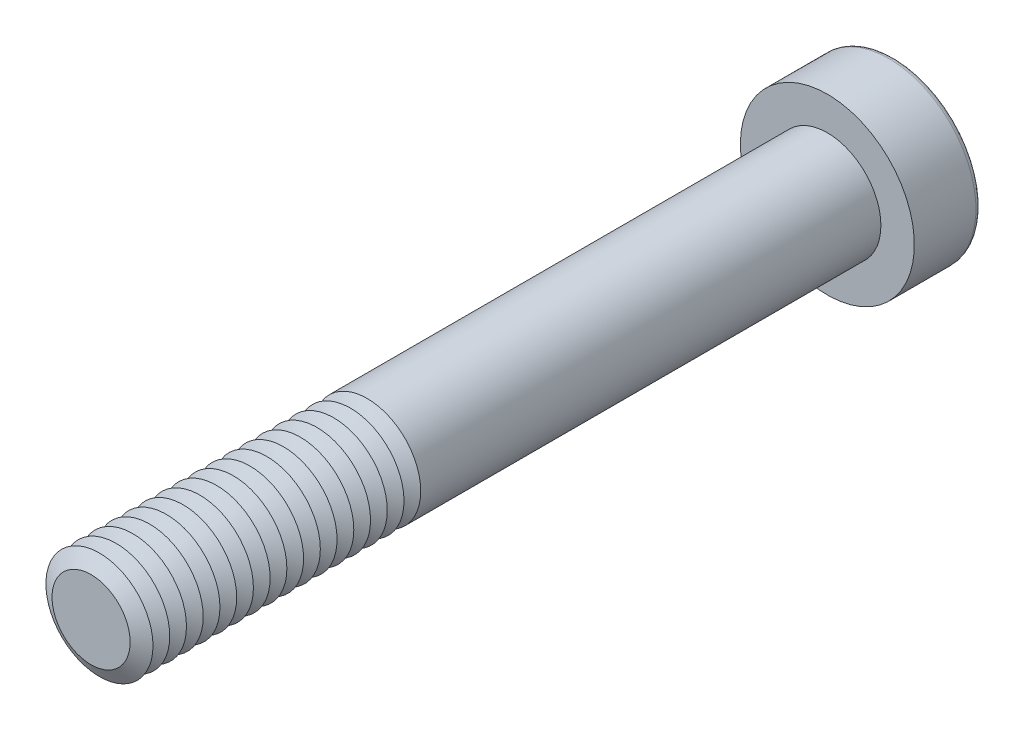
ISO-10303-21;
HEADER;
FILE_DESCRIPTION(('STEP AP214'),'2;1');
FILE_NAME('part.step','',(''),(''),'','','');
FILE_SCHEMA(('AUTOMOTIVE_DESIGN { 1 0 10303 214 1 1 1 1 }'));
ENDSEC;
DATA;
#1=APPLICATION_CONTEXT('core data for automotive mechanical design processes');
#2=APPLICATION_PROTOCOL_DEFINITION('international standard','automotive_design',2000,#1);
#3=PRODUCT_CONTEXT('',#1,'mechanical');
#4=PRODUCT('Part','Part','',(#3));
#5=PRODUCT_RELATED_PRODUCT_CATEGORY('part','',(#4));
#6=PRODUCT_DEFINITION_FORMATION('','',#4);
#7=PRODUCT_DEFINITION_CONTEXT('part definition',#1,'design');
#8=PRODUCT_DEFINITION('design','',#6,#7);
#9=PRODUCT_DEFINITION_SHAPE('','',#8);
#10=(LENGTH_UNIT() NAMED_UNIT(*) SI_UNIT(.MILLI.,.METRE.));
#11=(NAMED_UNIT(*) PLANE_ANGLE_UNIT() SI_UNIT($,.RADIAN.));
#12=(NAMED_UNIT(*) SI_UNIT($,.STERADIAN.) SOLID_ANGLE_UNIT());
#13=UNCERTAINTY_MEASURE_WITH_UNIT(LENGTH_MEASURE(1.E-05),#10,'distance_accuracy_value','');
#14=(GEOMETRIC_REPRESENTATION_CONTEXT(3) GLOBAL_UNCERTAINTY_ASSIGNED_CONTEXT((#13)) GLOBAL_UNIT_ASSIGNED_CONTEXT((#10,
#11,#12)) REPRESENTATION_CONTEXT('',''));
#15=CARTESIAN_POINT('',(0.,0.,0.));
#16=DIRECTION('',(0.,0.,1.));
#17=DIRECTION('',(1.,0.,0.));
#18=AXIS2_PLACEMENT_3D('',#15,#16,#17);
#19=CARTESIAN_POINT('',(0.,0.,50.625));
#20=DIRECTION('',(0.,0.,1.));
#21=DIRECTION('',(1.,0.,0.));
#22=AXIS2_PLACEMENT_3D('',#19,#20,#21);
#23=CONICAL_SURFACE('',#22,4.,1.0471975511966);
#24=CARTESIAN_POINT('',(0.,0.,50.));
#25=DIRECTION('',(0.,0.,1.));
#26=DIRECTION('',(1.,0.,0.));
#27=AXIS2_PLACEMENT_3D('',#24,#25,#26);
#28=CIRCLE('',#27,2.91746824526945);
#29=CARTESIAN_POINT('',(2.91746824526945,0.,50.));
#30=VERTEX_POINT('',#29);
#31=EDGE_CURVE('E313',#30,#30,#28,.T.);
#32=ORIENTED_EDGE('',*,*,#31,.T.);
#33=EDGE_LOOP('',(#32));
#34=FACE_BOUND('',#33,.T.);
#35=CARTESIAN_POINT('',(0.,0.,50.625));
#36=DIRECTION('',(0.,0.,1.));
#37=DIRECTION('',(1.,0.,0.));
#38=AXIS2_PLACEMENT_3D('',#35,#36,#37);
#39=CIRCLE('',#38,4.);
#40=CARTESIAN_POINT('',(4.,0.,50.625));
#41=VERTEX_POINT('',#40);
#42=EDGE_CURVE('E316',#41,#41,#39,.T.);
#43=ORIENTED_EDGE('',*,*,#42,.F.);
#44=EDGE_LOOP('',(#43));
#45=FACE_BOUND('',#44,.T.);
#46=ADVANCED_FACE('F39',(#34,#45),#23,.T.);
#47=CARTESIAN_POINT('',(0.,0.,50.));
#48=DIRECTION('',(0.,0.,-1.));
#49=DIRECTION('',(-1.,0.,0.));
#50=AXIS2_PLACEMENT_3D('',#47,#48,#49);
#51=CONICAL_SURFACE('',#50,2.91746824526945,1.0471975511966);
#52=CARTESIAN_POINT('',(0.,0.,49.375));
#53=DIRECTION('',(0.,0.,1.));
#54=DIRECTION('',(1.,0.,0.));
#55=AXIS2_PLACEMENT_3D('',#52,#53,#54);
#56=CIRCLE('',#55,4.);
#57=CARTESIAN_POINT('',(4.,0.,49.375));
#58=VERTEX_POINT('',#57);
#59=EDGE_CURVE('E324',#58,#58,#56,.T.);
#60=ORIENTED_EDGE('',*,*,#59,.T.);
#61=EDGE_LOOP('',(#60));
#62=FACE_BOUND('',#61,.T.);
#63=ORIENTED_EDGE('',*,*,#31,.F.);
#64=EDGE_LOOP('',(#63));
#65=FACE_BOUND('',#64,.T.);
#66=ADVANCED_FACE('F244',(#62,#65),#51,.T.);
#67=CARTESIAN_POINT('',(0.,0.,55.));
#68=DIRECTION('',(0.,0.,1.));
#69=DIRECTION('',(1.,0.,0.));
#70=AXIS2_PLACEMENT_3D('',#67,#68,#69);
#71=PLANE('',#70);
#72=CARTESIAN_POINT('',(0.,0.,55.));
#73=DIRECTION('',(0.,0.,1.));
#74=DIRECTION('',(1.,0.,0.));
#75=AXIS2_PLACEMENT_3D('',#72,#73,#74);
#76=CIRCLE('',#75,2.91746824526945);
#77=CARTESIAN_POINT('',(2.91746824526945,0.,55.));
#78=VERTEX_POINT('',#77);
#79=EDGE_CURVE('E174',#78,#78,#76,.T.);
#80=ORIENTED_EDGE('',*,*,#79,.T.);
#81=EDGE_LOOP('',(#80));
#82=FACE_BOUND('',#81,.T.);
#83=ADVANCED_FACE('F250',(#82),#71,.T.);
#84=CARTESIAN_POINT('',(0.,0.,55.));
#85=DIRECTION('',(0.,0.,-1.));
#86=DIRECTION('',(-1.,0.,0.));
#87=AXIS2_PLACEMENT_3D('',#84,#85,#86);
#88=CONICAL_SURFACE('',#87,2.91746824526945,1.0471975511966);
#89=CARTESIAN_POINT('',(0.,0.,54.375));
#90=DIRECTION('',(0.,0.,1.));
#91=DIRECTION('',(1.,0.,0.));
#92=AXIS2_PLACEMENT_3D('',#89,#90,#91);
#93=CIRCLE('',#92,4.);
#94=CARTESIAN_POINT('',(4.,0.,54.375));
#95=VERTEX_POINT('',#94);
#96=EDGE_CURVE('E290',#95,#95,#93,.T.);
#97=ORIENTED_EDGE('',*,*,#96,.T.);
#98=EDGE_LOOP('',(#97));
#99=FACE_BOUND('',#98,.T.);
#100=ORIENTED_EDGE('',*,*,#79,.F.);
#101=EDGE_LOOP('',(#100));
#102=FACE_BOUND('',#101,.T.);
#103=ADVANCED_FACE('F198',(#99,#102),#88,.T.);
#104=CARTESIAN_POINT('',(0.,0.,54.375));
#105=DIRECTION('',(0.,0.,1.));
#106=DIRECTION('',(1.,0.,0.));
#107=AXIS2_PLACEMENT_3D('',#104,#105,#106);
#108=CONICAL_SURFACE('',#107,4.,1.0471975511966);
#109=CARTESIAN_POINT('',(0.,0.,53.75));
#110=DIRECTION('',(0.,0.,1.));
#111=DIRECTION('',(1.,0.,0.));
#112=AXIS2_PLACEMENT_3D('',#109,#110,#111);
#113=CIRCLE('',#112,2.91746824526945);
#114=CARTESIAN_POINT('',(2.91746824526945,0.,53.75));
#115=VERTEX_POINT('',#114);
#116=EDGE_CURVE('E287',#115,#115,#113,.T.);
#117=ORIENTED_EDGE('',*,*,#116,.T.);
#118=EDGE_LOOP('',(#117));
#119=FACE_BOUND('',#118,.T.);
#120=ORIENTED_EDGE('',*,*,#96,.F.);
#121=EDGE_LOOP('',(#120));
#122=FACE_BOUND('',#121,.T.);
#123=ADVANCED_FACE('F276',(#119,#122),#108,.T.);
#124=CARTESIAN_POINT('',(0.,0.,53.75));
#125=DIRECTION('',(0.,0.,-1.));
#126=DIRECTION('',(-1.,0.,0.));
#127=AXIS2_PLACEMENT_3D('',#124,#125,#126);
#128=CONICAL_SURFACE('',#127,2.91746824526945,1.0471975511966);
#129=CARTESIAN_POINT('',(0.,0.,53.125));
#130=DIRECTION('',(0.,0.,1.));
#131=DIRECTION('',(1.,0.,0.));
#132=AXIS2_PLACEMENT_3D('',#129,#130,#131);
#133=CIRCLE('',#132,4.);
#134=CARTESIAN_POINT('',(4.,0.,53.125));
#135=VERTEX_POINT('',#134);
#136=EDGE_CURVE('E299',#135,#135,#133,.T.);
#137=ORIENTED_EDGE('',*,*,#136,.T.);
#138=EDGE_LOOP('',(#137));
#139=FACE_BOUND('',#138,.T.);
#140=ORIENTED_EDGE('',*,*,#116,.F.);
#141=EDGE_LOOP('',(#140));
#142=FACE_BOUND('',#141,.T.);
#143=ADVANCED_FACE('F273',(#139,#142),#128,.T.);
#144=CARTESIAN_POINT('',(0.,0.,53.125));
#145=DIRECTION('',(0.,0.,1.));
#146=DIRECTION('',(1.,0.,0.));
#147=AXIS2_PLACEMENT_3D('',#144,#145,#146);
#148=CONICAL_SURFACE('',#147,4.,1.0471975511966);
#149=CARTESIAN_POINT('',(0.,0.,52.5));
#150=DIRECTION('',(0.,0.,1.));
#151=DIRECTION('',(1.,0.,0.));
#152=AXIS2_PLACEMENT_3D('',#149,#150,#151);
#153=CIRCLE('',#152,2.91746824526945);
#154=CARTESIAN_POINT('',(2.91746824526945,0.,52.5));
#155=VERTEX_POINT('',#154);
#156=EDGE_CURVE('E292',#155,#155,#153,.T.);
#157=ORIENTED_EDGE('',*,*,#156,.T.);
#158=EDGE_LOOP('',(#157));
#159=FACE_BOUND('',#158,.T.);
#160=ORIENTED_EDGE('',*,*,#136,.F.);
#161=EDGE_LOOP('',(#160));
#162=FACE_BOUND('',#161,.T.);
#163=ADVANCED_FACE('F269',(#159,#162),#148,.T.);
#164=CARTESIAN_POINT('',(0.,0.,52.5));
#165=DIRECTION('',(0.,0.,-1.));
#166=DIRECTION('',(-1.,0.,0.));
#167=AXIS2_PLACEMENT_3D('',#164,#165,#166);
#168=CONICAL_SURFACE('',#167,2.91746824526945,1.0471975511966);
#169=CARTESIAN_POINT('',(0.,0.,51.875));
#170=DIRECTION('',(0.,0.,1.));
#171=DIRECTION('',(1.,0.,0.));
#172=AXIS2_PLACEMENT_3D('',#169,#170,#171);
#173=CIRCLE('',#172,4.);
#174=CARTESIAN_POINT('',(4.,0.,51.875));
#175=VERTEX_POINT('',#174);
#176=EDGE_CURVE('E309',#175,#175,#173,.T.);
#177=ORIENTED_EDGE('',*,*,#176,.T.);
#178=EDGE_LOOP('',(#177));
#179=FACE_BOUND('',#178,.T.);
#180=ORIENTED_EDGE('',*,*,#156,.F.);
#181=EDGE_LOOP('',(#180));
#182=FACE_BOUND('',#181,.T.);
#183=ADVANCED_FACE('F265',(#179,#182),#168,.T.);
#184=CARTESIAN_POINT('',(0.,0.,51.875));
#185=DIRECTION('',(0.,0.,1.));
#186=DIRECTION('',(1.,0.,0.));
#187=AXIS2_PLACEMENT_3D('',#184,#185,#186);
#188=CONICAL_SURFACE('',#187,4.,1.0471975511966);
#189=CARTESIAN_POINT('',(0.,0.,51.25));
#190=DIRECTION('',(0.,0.,1.));
#191=DIRECTION('',(1.,0.,0.));
#192=AXIS2_PLACEMENT_3D('',#189,#190,#191);
#193=CIRCLE('',#192,2.91746824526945);
#194=CARTESIAN_POINT('',(2.91746824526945,0.,51.25));
#195=VERTEX_POINT('',#194);
#196=EDGE_CURVE('E305',#195,#195,#193,.T.);
#197=ORIENTED_EDGE('',*,*,#196,.T.);
#198=EDGE_LOOP('',(#197));
#199=FACE_BOUND('',#198,.T.);
#200=ORIENTED_EDGE('',*,*,#176,.F.);
#201=EDGE_LOOP('',(#200));
#202=FACE_BOUND('',#201,.T.);
#203=ADVANCED_FACE('F261',(#199,#202),#188,.T.);
#204=CARTESIAN_POINT('',(0.,0.,51.25));
#205=DIRECTION('',(0.,0.,-1.));
#206=DIRECTION('',(-1.,0.,0.));
#207=AXIS2_PLACEMENT_3D('',#204,#205,#206);
#208=CONICAL_SURFACE('',#207,2.91746824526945,1.0471975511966);
#209=ORIENTED_EDGE('',*,*,#42,.T.);
#210=EDGE_LOOP('',(#209));
#211=FACE_BOUND('',#210,.T.);
#212=ORIENTED_EDGE('',*,*,#196,.F.);
#213=EDGE_LOOP('',(#212));
#214=FACE_BOUND('',#213,.T.);
#215=ADVANCED_FACE('F257',(#211,#214),#208,.T.);
#216=CARTESIAN_POINT('',(0.,0.,49.375));
#217=DIRECTION('',(0.,0.,1.));
#218=DIRECTION('',(1.,0.,0.));
#219=AXIS2_PLACEMENT_3D('',#216,#217,#218);
#220=CONICAL_SURFACE('',#219,4.,1.0471975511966);
#221=CARTESIAN_POINT('',(0.,0.,48.75));
#222=DIRECTION('',(0.,0.,1.));
#223=DIRECTION('',(1.,0.,0.));
#224=AXIS2_PLACEMENT_3D('',#221,#222,#223);
#225=CIRCLE('',#224,2.91746824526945);
#226=CARTESIAN_POINT('',(2.91746824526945,0.,48.75));
#227=VERTEX_POINT('',#226);
#228=EDGE_CURVE('E320',#227,#227,#225,.T.);
#229=ORIENTED_EDGE('',*,*,#228,.T.);
#230=EDGE_LOOP('',(#229));
#231=FACE_BOUND('',#230,.T.);
#232=ORIENTED_EDGE('',*,*,#59,.F.);
#233=EDGE_LOOP('',(#232));
#234=FACE_BOUND('',#233,.T.);
#235=ADVANCED_FACE('F260',(#231,#234),#220,.T.);
#236=CARTESIAN_POINT('',(0.,0.,48.75));
#237=DIRECTION('',(0.,0.,-1.));
#238=DIRECTION('',(-1.,0.,0.));
#239=AXIS2_PLACEMENT_3D('',#236,#237,#238);
#240=CONICAL_SURFACE('',#239,2.91746824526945,1.0471975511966);
#241=CARTESIAN_POINT('',(0.,0.,48.125));
#242=DIRECTION('',(0.,0.,1.));
#243=DIRECTION('',(1.,0.,0.));
#244=AXIS2_PLACEMENT_3D('',#241,#242,#243);
#245=CIRCLE('',#244,4.);
#246=CARTESIAN_POINT('',(4.,0.,48.125));
#247=VERTEX_POINT('',#246);
#248=EDGE_CURVE('E332',#247,#247,#245,.T.);
#249=ORIENTED_EDGE('',*,*,#248,.T.);
#250=EDGE_LOOP('',(#249));
#251=FACE_BOUND('',#250,.T.);
#252=ORIENTED_EDGE('',*,*,#228,.F.);
#253=EDGE_LOOP('',(#252));
#254=FACE_BOUND('',#253,.T.);
#255=ADVANCED_FACE('F512',(#251,#254),#240,.T.);
#256=CARTESIAN_POINT('',(0.,0.,48.125));
#257=DIRECTION('',(0.,0.,1.));
#258=DIRECTION('',(1.,0.,0.));
#259=AXIS2_PLACEMENT_3D('',#256,#257,#258);
#260=CONICAL_SURFACE('',#259,4.,1.0471975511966);
#261=CARTESIAN_POINT('',(0.,0.,47.5));
#262=DIRECTION('',(0.,0.,1.));
#263=DIRECTION('',(1.,0.,0.));
#264=AXIS2_PLACEMENT_3D('',#261,#262,#263);
#265=CIRCLE('',#264,2.91746824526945);
#266=CARTESIAN_POINT('',(2.91746824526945,0.,47.5));
#267=VERTEX_POINT('',#266);
#268=EDGE_CURVE('E328',#267,#267,#265,.T.);
#269=ORIENTED_EDGE('',*,*,#268,.T.);
#270=EDGE_LOOP('',(#269));
#271=FACE_BOUND('',#270,.T.);
#272=ORIENTED_EDGE('',*,*,#248,.F.);
#273=EDGE_LOOP('',(#272));
#274=FACE_BOUND('',#273,.T.);
#275=ADVANCED_FACE('F508',(#271,#274),#260,.T.);
#276=CARTESIAN_POINT('',(0.,0.,47.5));
#277=DIRECTION('',(0.,0.,-1.));
#278=DIRECTION('',(-1.,0.,0.));
#279=AXIS2_PLACEMENT_3D('',#276,#277,#278);
#280=CONICAL_SURFACE('',#279,2.91746824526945,1.0471975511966);
#281=CARTESIAN_POINT('',(0.,0.,46.875));
#282=DIRECTION('',(0.,0.,1.));
#283=DIRECTION('',(1.,0.,0.));
#284=AXIS2_PLACEMENT_3D('',#281,#282,#283);
#285=CIRCLE('',#284,4.);
#286=CARTESIAN_POINT('',(4.,0.,46.875));
#287=VERTEX_POINT('',#286);
#288=EDGE_CURVE('E340',#287,#287,#285,.T.);
#289=ORIENTED_EDGE('',*,*,#288,.T.);
#290=EDGE_LOOP('',(#289));
#291=FACE_BOUND('',#290,.T.);
#292=ORIENTED_EDGE('',*,*,#268,.F.);
#293=EDGE_LOOP('',(#292));
#294=FACE_BOUND('',#293,.T.);
#295=ADVANCED_FACE('F504',(#291,#294),#280,.T.);
#296=CARTESIAN_POINT('',(0.,0.,46.875));
#297=DIRECTION('',(0.,0.,1.));
#298=DIRECTION('',(1.,0.,0.));
#299=AXIS2_PLACEMENT_3D('',#296,#297,#298);
#300=CONICAL_SURFACE('',#299,4.,1.0471975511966);
#301=CARTESIAN_POINT('',(0.,0.,46.25));
#302=DIRECTION('',(0.,0.,1.));
#303=DIRECTION('',(1.,0.,0.));
#304=AXIS2_PLACEMENT_3D('',#301,#302,#303);
#305=CIRCLE('',#304,2.91746824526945);
#306=CARTESIAN_POINT('',(2.91746824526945,0.,46.25));
#307=VERTEX_POINT('',#306);
#308=EDGE_CURVE('E336',#307,#307,#305,.T.);
#309=ORIENTED_EDGE('',*,*,#308,.T.);
#310=EDGE_LOOP('',(#309));
#311=FACE_BOUND('',#310,.T.);
#312=ORIENTED_EDGE('',*,*,#288,.F.);
#313=EDGE_LOOP('',(#312));
#314=FACE_BOUND('',#313,.T.);
#315=ADVANCED_FACE('F500',(#311,#314),#300,.T.);
#316=CARTESIAN_POINT('',(0.,0.,46.25));
#317=DIRECTION('',(0.,0.,-1.));
#318=DIRECTION('',(-1.,0.,0.));
#319=AXIS2_PLACEMENT_3D('',#316,#317,#318);
#320=CONICAL_SURFACE('',#319,2.91746824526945,1.0471975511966);
#321=CARTESIAN_POINT('',(0.,0.,45.625));
#322=DIRECTION('',(0.,0.,1.));
#323=DIRECTION('',(1.,0.,0.));
#324=AXIS2_PLACEMENT_3D('',#321,#322,#323);
#325=CIRCLE('',#324,4.);
#326=CARTESIAN_POINT('',(4.,0.,45.625));
#327=VERTEX_POINT('',#326);
#328=EDGE_CURVE('E348',#327,#327,#325,.T.);
#329=ORIENTED_EDGE('',*,*,#328,.T.);
#330=EDGE_LOOP('',(#329));
#331=FACE_BOUND('',#330,.T.);
#332=ORIENTED_EDGE('',*,*,#308,.F.);
#333=EDGE_LOOP('',(#332));
#334=FACE_BOUND('',#333,.T.);
#335=ADVANCED_FACE('F496',(#331,#334),#320,.T.);
#336=CARTESIAN_POINT('',(0.,0.,45.625));
#337=DIRECTION('',(0.,0.,1.));
#338=DIRECTION('',(1.,0.,0.));
#339=AXIS2_PLACEMENT_3D('',#336,#337,#338);
#340=CONICAL_SURFACE('',#339,4.,1.0471975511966);
#341=CARTESIAN_POINT('',(0.,0.,45.));
#342=DIRECTION('',(0.,0.,1.));
#343=DIRECTION('',(1.,0.,0.));
#344=AXIS2_PLACEMENT_3D('',#341,#342,#343);
#345=CIRCLE('',#344,2.91746824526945);
#346=CARTESIAN_POINT('',(2.91746824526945,0.,45.));
#347=VERTEX_POINT('',#346);
#348=EDGE_CURVE('E344',#347,#347,#345,.T.);
#349=ORIENTED_EDGE('',*,*,#348,.T.);
#350=EDGE_LOOP('',(#349));
#351=FACE_BOUND('',#350,.T.);
#352=ORIENTED_EDGE('',*,*,#328,.F.);
#353=EDGE_LOOP('',(#352));
#354=FACE_BOUND('',#353,.T.);
#355=ADVANCED_FACE('F492',(#351,#354),#340,.T.);
#356=CARTESIAN_POINT('',(0.,0.,45.));
#357=DIRECTION('',(0.,0.,-1.));
#358=DIRECTION('',(-1.,0.,0.));
#359=AXIS2_PLACEMENT_3D('',#356,#357,#358);
#360=CONICAL_SURFACE('',#359,2.91746824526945,1.0471975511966);
#361=CARTESIAN_POINT('',(0.,0.,44.375));
#362=DIRECTION('',(0.,0.,1.));
#363=DIRECTION('',(1.,0.,0.));
#364=AXIS2_PLACEMENT_3D('',#361,#362,#363);
#365=CIRCLE('',#364,4.);
#366=CARTESIAN_POINT('',(4.,0.,44.375));
#367=VERTEX_POINT('',#366);
#368=EDGE_CURVE('E356',#367,#367,#365,.T.);
#369=ORIENTED_EDGE('',*,*,#368,.T.);
#370=EDGE_LOOP('',(#369));
#371=FACE_BOUND('',#370,.T.);
#372=ORIENTED_EDGE('',*,*,#348,.F.);
#373=EDGE_LOOP('',(#372));
#374=FACE_BOUND('',#373,.T.);
#375=ADVANCED_FACE('F488',(#371,#374),#360,.T.);
#376=CARTESIAN_POINT('',(0.,0.,44.375));
#377=DIRECTION('',(0.,0.,1.));
#378=DIRECTION('',(1.,0.,0.));
#379=AXIS2_PLACEMENT_3D('',#376,#377,#378);
#380=CONICAL_SURFACE('',#379,4.,1.0471975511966);
#381=CARTESIAN_POINT('',(0.,0.,43.75));
#382=DIRECTION('',(0.,0.,1.));
#383=DIRECTION('',(1.,0.,0.));
#384=AXIS2_PLACEMENT_3D('',#381,#382,#383);
#385=CIRCLE('',#384,2.91746824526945);
#386=CARTESIAN_POINT('',(2.91746824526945,0.,43.75));
#387=VERTEX_POINT('',#386);
#388=EDGE_CURVE('E352',#387,#387,#385,.T.);
#389=ORIENTED_EDGE('',*,*,#388,.T.);
#390=EDGE_LOOP('',(#389));
#391=FACE_BOUND('',#390,.T.);
#392=ORIENTED_EDGE('',*,*,#368,.F.);
#393=EDGE_LOOP('',(#392));
#394=FACE_BOUND('',#393,.T.);
#395=ADVANCED_FACE('F484',(#391,#394),#380,.T.);
#396=CARTESIAN_POINT('',(0.,0.,43.75));
#397=DIRECTION('',(0.,0.,-1.));
#398=DIRECTION('',(-1.,0.,0.));
#399=AXIS2_PLACEMENT_3D('',#396,#397,#398);
#400=CONICAL_SURFACE('',#399,2.91746824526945,1.0471975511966);
#401=CARTESIAN_POINT('',(0.,0.,43.125));
#402=DIRECTION('',(0.,0.,1.));
#403=DIRECTION('',(1.,0.,0.));
#404=AXIS2_PLACEMENT_3D('',#401,#402,#403);
#405=CIRCLE('',#404,4.);
#406=CARTESIAN_POINT('',(4.,0.,43.125));
#407=VERTEX_POINT('',#406);
#408=EDGE_CURVE('E364',#407,#407,#405,.T.);
#409=ORIENTED_EDGE('',*,*,#408,.T.);
#410=EDGE_LOOP('',(#409));
#411=FACE_BOUND('',#410,.T.);
#412=ORIENTED_EDGE('',*,*,#388,.F.);
#413=EDGE_LOOP('',(#412));
#414=FACE_BOUND('',#413,.T.);
#415=ADVANCED_FACE('F480',(#411,#414),#400,.T.);
#416=CARTESIAN_POINT('',(0.,0.,43.125));
#417=DIRECTION('',(0.,0.,1.));
#418=DIRECTION('',(1.,0.,0.));
#419=AXIS2_PLACEMENT_3D('',#416,#417,#418);
#420=CONICAL_SURFACE('',#419,4.,1.0471975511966);
#421=CARTESIAN_POINT('',(0.,0.,42.5));
#422=DIRECTION('',(0.,0.,1.));
#423=DIRECTION('',(1.,0.,0.));
#424=AXIS2_PLACEMENT_3D('',#421,#422,#423);
#425=CIRCLE('',#424,2.91746824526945);
#426=CARTESIAN_POINT('',(2.91746824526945,0.,42.5));
#427=VERTEX_POINT('',#426);
#428=EDGE_CURVE('E360',#427,#427,#425,.T.);
#429=ORIENTED_EDGE('',*,*,#428,.T.);
#430=EDGE_LOOP('',(#429));
#431=FACE_BOUND('',#430,.T.);
#432=ORIENTED_EDGE('',*,*,#408,.F.);
#433=EDGE_LOOP('',(#432));
#434=FACE_BOUND('',#433,.T.);
#435=ADVANCED_FACE('F476',(#431,#434),#420,.T.);
#436=CARTESIAN_POINT('',(0.,0.,42.5));
#437=DIRECTION('',(0.,0.,-1.));
#438=DIRECTION('',(-1.,0.,0.));
#439=AXIS2_PLACEMENT_3D('',#436,#437,#438);
#440=CONICAL_SURFACE('',#439,2.91746824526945,1.0471975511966);
#441=CARTESIAN_POINT('',(0.,0.,41.875));
#442=DIRECTION('',(0.,0.,1.));
#443=DIRECTION('',(1.,0.,0.));
#444=AXIS2_PLACEMENT_3D('',#441,#442,#443);
#445=CIRCLE('',#444,4.);
#446=CARTESIAN_POINT('',(4.,0.,41.875));
#447=VERTEX_POINT('',#446);
#448=EDGE_CURVE('E371',#447,#447,#445,.T.);
#449=ORIENTED_EDGE('',*,*,#448,.T.);
#450=EDGE_LOOP('',(#449));
#451=FACE_BOUND('',#450,.T.);
#452=ORIENTED_EDGE('',*,*,#428,.F.);
#453=EDGE_LOOP('',(#452));
#454=FACE_BOUND('',#453,.T.);
#455=ADVANCED_FACE('F472',(#451,#454),#440,.T.);
#456=CARTESIAN_POINT('',(0.,0.,41.875));
#457=DIRECTION('',(0.,0.,1.));
#458=DIRECTION('',(1.,0.,0.));
#459=AXIS2_PLACEMENT_3D('',#456,#457,#458);
#460=CONICAL_SURFACE('',#459,4.,1.0471975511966);
#461=CARTESIAN_POINT('',(0.,0.,41.25));
#462=DIRECTION('',(0.,0.,1.));
#463=DIRECTION('',(1.,0.,0.));
#464=AXIS2_PLACEMENT_3D('',#461,#462,#463);
#465=CIRCLE('',#464,2.91746824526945);
#466=CARTESIAN_POINT('',(2.91746824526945,0.,41.25));
#467=VERTEX_POINT('',#466);
#468=EDGE_CURVE('E367',#467,#467,#465,.T.);
#469=ORIENTED_EDGE('',*,*,#468,.T.);
#470=EDGE_LOOP('',(#469));
#471=FACE_BOUND('',#470,.T.);
#472=ORIENTED_EDGE('',*,*,#448,.F.);
#473=EDGE_LOOP('',(#472));
#474=FACE_BOUND('',#473,.T.);
#475=ADVANCED_FACE('F468',(#471,#474),#460,.T.);
#476=CARTESIAN_POINT('',(0.,0.,41.25));
#477=DIRECTION('',(0.,0.,-1.));
#478=DIRECTION('',(-1.,0.,0.));
#479=AXIS2_PLACEMENT_3D('',#476,#477,#478);
#480=CONICAL_SURFACE('',#479,2.91746824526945,1.0471975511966);
#481=CARTESIAN_POINT('',(0.,0.,40.625));
#482=DIRECTION('',(0.,0.,1.));
#483=DIRECTION('',(1.,0.,0.));
#484=AXIS2_PLACEMENT_3D('',#481,#482,#483);
#485=CIRCLE('',#484,4.);
#486=CARTESIAN_POINT('',(4.,0.,40.625));
#487=VERTEX_POINT('',#486);
#488=EDGE_CURVE('E379',#487,#487,#485,.T.);
#489=ORIENTED_EDGE('',*,*,#488,.T.);
#490=EDGE_LOOP('',(#489));
#491=FACE_BOUND('',#490,.T.);
#492=ORIENTED_EDGE('',*,*,#468,.F.);
#493=EDGE_LOOP('',(#492));
#494=FACE_BOUND('',#493,.T.);
#495=ADVANCED_FACE('F464',(#491,#494),#480,.T.);
#496=CARTESIAN_POINT('',(0.,0.,40.625));
#497=DIRECTION('',(0.,0.,1.));
#498=DIRECTION('',(1.,0.,0.));
#499=AXIS2_PLACEMENT_3D('',#496,#497,#498);
#500=CONICAL_SURFACE('',#499,4.,1.0471975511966);
#501=CARTESIAN_POINT('',(0.,0.,40.));
#502=DIRECTION('',(0.,0.,1.));
#503=DIRECTION('',(1.,0.,0.));
#504=AXIS2_PLACEMENT_3D('',#501,#502,#503);
#505=CIRCLE('',#504,2.91746824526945);
#506=CARTESIAN_POINT('',(2.91746824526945,0.,40.));
#507=VERTEX_POINT('',#506);
#508=EDGE_CURVE('E375',#507,#507,#505,.T.);
#509=ORIENTED_EDGE('',*,*,#508,.T.);
#510=EDGE_LOOP('',(#509));
#511=FACE_BOUND('',#510,.T.);
#512=ORIENTED_EDGE('',*,*,#488,.F.);
#513=EDGE_LOOP('',(#512));
#514=FACE_BOUND('',#513,.T.);
#515=ADVANCED_FACE('F460',(#511,#514),#500,.T.);
#516=CARTESIAN_POINT('',(0.,0.,40.));
#517=DIRECTION('',(0.,0.,-1.));
#518=DIRECTION('',(-1.,0.,0.));
#519=AXIS2_PLACEMENT_3D('',#516,#517,#518);
#520=CONICAL_SURFACE('',#519,2.91746824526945,1.0471975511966);
#521=CARTESIAN_POINT('',(0.,0.,39.375));
#522=DIRECTION('',(0.,0.,1.));
#523=DIRECTION('',(1.,0.,0.));
#524=AXIS2_PLACEMENT_3D('',#521,#522,#523);
#525=CIRCLE('',#524,4.);
#526=CARTESIAN_POINT('',(4.,0.,39.375));
#527=VERTEX_POINT('',#526);
#528=EDGE_CURVE('E387',#527,#527,#525,.T.);
#529=ORIENTED_EDGE('',*,*,#528,.T.);
#530=EDGE_LOOP('',(#529));
#531=FACE_BOUND('',#530,.T.);
#532=ORIENTED_EDGE('',*,*,#508,.F.);
#533=EDGE_LOOP('',(#532));
#534=FACE_BOUND('',#533,.T.);
#535=ADVANCED_FACE('F456',(#531,#534),#520,.T.);
#536=CARTESIAN_POINT('',(0.,0.,39.375));
#537=DIRECTION('',(0.,0.,1.));
#538=DIRECTION('',(1.,0.,0.));
#539=AXIS2_PLACEMENT_3D('',#536,#537,#538);
#540=CONICAL_SURFACE('',#539,4.,1.0471975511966);
#541=CARTESIAN_POINT('',(0.,0.,38.75));
#542=DIRECTION('',(0.,0.,1.));
#543=DIRECTION('',(1.,0.,0.));
#544=AXIS2_PLACEMENT_3D('',#541,#542,#543);
#545=CIRCLE('',#544,2.91746824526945);
#546=CARTESIAN_POINT('',(2.91746824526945,0.,38.75));
#547=VERTEX_POINT('',#546);
#548=EDGE_CURVE('E383',#547,#547,#545,.T.);
#549=ORIENTED_EDGE('',*,*,#548,.T.);
#550=EDGE_LOOP('',(#549));
#551=FACE_BOUND('',#550,.T.);
#552=ORIENTED_EDGE('',*,*,#528,.F.);
#553=EDGE_LOOP('',(#552));
#554=FACE_BOUND('',#553,.T.);
#555=ADVANCED_FACE('F452',(#551,#554),#540,.T.);
#556=CARTESIAN_POINT('',(0.,0.,38.75));
#557=DIRECTION('',(0.,0.,-1.));
#558=DIRECTION('',(-1.,0.,0.));
#559=AXIS2_PLACEMENT_3D('',#556,#557,#558);
#560=CONICAL_SURFACE('',#559,2.91746824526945,1.0471975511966);
#561=CARTESIAN_POINT('',(0.,0.,38.125));
#562=DIRECTION('',(0.,0.,1.));
#563=DIRECTION('',(1.,0.,0.));
#564=AXIS2_PLACEMENT_3D('',#561,#562,#563);
#565=CIRCLE('',#564,4.);
#566=CARTESIAN_POINT('',(4.,0.,38.125));
#567=VERTEX_POINT('',#566);
#568=EDGE_CURVE('E395',#567,#567,#565,.T.);
#569=ORIENTED_EDGE('',*,*,#568,.T.);
#570=EDGE_LOOP('',(#569));
#571=FACE_BOUND('',#570,.T.);
#572=ORIENTED_EDGE('',*,*,#548,.F.);
#573=EDGE_LOOP('',(#572));
#574=FACE_BOUND('',#573,.T.);
#575=ADVANCED_FACE('F448',(#571,#574),#560,.T.);
#576=CARTESIAN_POINT('',(0.,0.,38.125));
#577=DIRECTION('',(0.,0.,1.));
#578=DIRECTION('',(1.,0.,0.));
#579=AXIS2_PLACEMENT_3D('',#576,#577,#578);
#580=CONICAL_SURFACE('',#579,4.,1.0471975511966);
#581=CARTESIAN_POINT('',(0.,0.,37.5));
#582=DIRECTION('',(0.,0.,1.));
#583=DIRECTION('',(1.,0.,0.));
#584=AXIS2_PLACEMENT_3D('',#581,#582,#583);
#585=CIRCLE('',#584,2.91746824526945);
#586=CARTESIAN_POINT('',(2.91746824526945,0.,37.5));
#587=VERTEX_POINT('',#586);
#588=EDGE_CURVE('E391',#587,#587,#585,.T.);
#589=ORIENTED_EDGE('',*,*,#588,.T.);
#590=EDGE_LOOP('',(#589));
#591=FACE_BOUND('',#590,.T.);
#592=ORIENTED_EDGE('',*,*,#568,.F.);
#593=EDGE_LOOP('',(#592));
#594=FACE_BOUND('',#593,.T.);
#595=ADVANCED_FACE('F444',(#591,#594),#580,.T.);
#596=CARTESIAN_POINT('',(0.,0.,37.5));
#597=DIRECTION('',(0.,0.,-1.));
#598=DIRECTION('',(-1.,0.,0.));
#599=AXIS2_PLACEMENT_3D('',#596,#597,#598);
#600=CONICAL_SURFACE('',#599,2.91746824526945,1.0471975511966);
#601=CARTESIAN_POINT('',(0.,0.,36.875));
#602=DIRECTION('',(0.,0.,1.));
#603=DIRECTION('',(1.,0.,0.));
#604=AXIS2_PLACEMENT_3D('',#601,#602,#603);
#605=CIRCLE('',#604,4.);
#606=CARTESIAN_POINT('',(4.,0.,36.875));
#607=VERTEX_POINT('',#606);
#608=EDGE_CURVE('E403',#607,#607,#605,.T.);
#609=ORIENTED_EDGE('',*,*,#608,.T.);
#610=EDGE_LOOP('',(#609));
#611=FACE_BOUND('',#610,.T.);
#612=ORIENTED_EDGE('',*,*,#588,.F.);
#613=EDGE_LOOP('',(#612));
#614=FACE_BOUND('',#613,.T.);
#615=ADVANCED_FACE('F440',(#611,#614),#600,.T.);
#616=CARTESIAN_POINT('',(0.,0.,36.875));
#617=DIRECTION('',(0.,0.,1.));
#618=DIRECTION('',(1.,0.,0.));
#619=AXIS2_PLACEMENT_3D('',#616,#617,#618);
#620=CONICAL_SURFACE('',#619,4.,1.0471975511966);
#621=CARTESIAN_POINT('',(0.,0.,36.25));
#622=DIRECTION('',(0.,0.,1.));
#623=DIRECTION('',(1.,0.,0.));
#624=AXIS2_PLACEMENT_3D('',#621,#622,#623);
#625=CIRCLE('',#624,2.91746824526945);
#626=CARTESIAN_POINT('',(2.91746824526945,0.,36.25));
#627=VERTEX_POINT('',#626);
#628=EDGE_CURVE('E399',#627,#627,#625,.T.);
#629=ORIENTED_EDGE('',*,*,#628,.T.);
#630=EDGE_LOOP('',(#629));
#631=FACE_BOUND('',#630,.T.);
#632=ORIENTED_EDGE('',*,*,#608,.F.);
#633=EDGE_LOOP('',(#632));
#634=FACE_BOUND('',#633,.T.);
#635=ADVANCED_FACE('F435',(#631,#634),#620,.T.);
#636=CARTESIAN_POINT('',(0.,0.,36.25));
#637=DIRECTION('',(0.,0.,-1.));
#638=DIRECTION('',(-1.,0.,0.));
#639=AXIS2_PLACEMENT_3D('',#636,#637,#638);
#640=CONICAL_SURFACE('',#639,2.91746824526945,1.0471975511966);
#641=CARTESIAN_POINT('',(0.,0.,35.625));
#642=DIRECTION('',(0.,0.,1.));
#643=DIRECTION('',(1.,0.,0.));
#644=AXIS2_PLACEMENT_3D('',#641,#642,#643);
#645=CIRCLE('',#644,4.);
#646=CARTESIAN_POINT('',(4.,0.,35.625));
#647=VERTEX_POINT('',#646);
#648=EDGE_CURVE('E415',#647,#647,#645,.T.);
#649=ORIENTED_EDGE('',*,*,#648,.T.);
#650=EDGE_LOOP('',(#649));
#651=FACE_BOUND('',#650,.T.);
#652=ORIENTED_EDGE('',*,*,#628,.F.);
#653=EDGE_LOOP('',(#652));
#654=FACE_BOUND('',#653,.T.);
#655=ADVANCED_FACE('F421',(#651,#654),#640,.T.);
#656=CARTESIAN_POINT('',(0.,0.,35.625));
#657=DIRECTION('',(0.,0.,1.));
#658=DIRECTION('',(1.,0.,0.));
#659=AXIS2_PLACEMENT_3D('',#656,#657,#658);
#660=CONICAL_SURFACE('',#659,4.,1.0471975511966);
#661=CARTESIAN_POINT('',(0.,0.,35.));
#662=DIRECTION('',(0.,0.,1.));
#663=DIRECTION('',(1.,0.,0.));
#664=AXIS2_PLACEMENT_3D('',#661,#662,#663);
#665=CIRCLE('',#664,2.91746824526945);
#666=CARTESIAN_POINT('',(2.91746824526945,0.,35.));
#667=VERTEX_POINT('',#666);
#668=EDGE_CURVE('E407',#667,#667,#665,.T.);
#669=ORIENTED_EDGE('',*,*,#668,.T.);
#670=EDGE_LOOP('',(#669));
#671=FACE_BOUND('',#670,.T.);
#672=ORIENTED_EDGE('',*,*,#648,.F.);
#673=EDGE_LOOP('',(#672));
#674=FACE_BOUND('',#673,.T.);
#675=ADVANCED_FACE('F424',(#671,#674),#660,.T.);
#676=CARTESIAN_POINT('',(0.,0.,35.));
#677=DIRECTION('',(0.,0.,-1.));
#678=DIRECTION('',(-1.,0.,0.));
#679=AXIS2_PLACEMENT_3D('',#676,#677,#678);
#680=CONICAL_SURFACE('',#679,2.91746824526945,1.0471975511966);
#681=CARTESIAN_POINT('',(0.,0.,34.375));
#682=DIRECTION('',(0.,0.,1.));
#683=DIRECTION('',(1.,0.,0.));
#684=AXIS2_PLACEMENT_3D('',#681,#682,#683);
#685=CIRCLE('',#684,4.);
#686=CARTESIAN_POINT('',(4.,0.,34.375));
#687=VERTEX_POINT('',#686);
#688=EDGE_CURVE('E411',#687,#687,#685,.T.);
#689=ORIENTED_EDGE('',*,*,#688,.T.);
#690=EDGE_LOOP('',(#689));
#691=FACE_BOUND('',#690,.T.);
#692=ORIENTED_EDGE('',*,*,#668,.F.);
#693=EDGE_LOOP('',(#692));
#694=FACE_BOUND('',#693,.T.);
#695=ADVANCED_FACE('F426',(#691,#694),#680,.T.);
#696=CARTESIAN_POINT('',(0.,0.,-1.25));
#697=DIRECTION('',(0.,0.,-1.));
#698=DIRECTION('',(-1.,0.,0.));
#699=AXIS2_PLACEMENT_3D('',#696,#697,#698);
#700=CONICAL_SURFACE('',#699,2.5,1.0471975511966);
#701=CARTESIAN_POINT('',(0.,0.,0.193375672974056));
#702=VERTEX_POINT('',#701);
#703=VERTEX_LOOP('',#702);
#704=FACE_BOUND('',#703,.T.);
#705=CARTESIAN_POINT('',(0.,0.,-1.25));
#706=DIRECTION('',(0.,0.,-1.));
#707=DIRECTION('',(-1.,0.,0.));
#708=AXIS2_PLACEMENT_3D('',#705,#706,#707);
#709=CIRCLE('',#708,2.5);
#710=CARTESIAN_POINT('',(-2.1650635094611,1.25,-1.25));
#711=VERTEX_POINT('',#710);
#712=CARTESIAN_POINT('',(0.,2.5,-1.25));
#713=VERTEX_POINT('',#712);
#714=EDGE_CURVE('E149',#711,#713,#709,.T.);
#715=ORIENTED_EDGE('',*,*,#714,.T.);
#716=CARTESIAN_POINT('',(0.,0.,-1.25));
#717=DIRECTION('',(0.,0.,-1.));
#718=DIRECTION('',(-1.,0.,0.));
#719=AXIS2_PLACEMENT_3D('',#716,#717,#718);
#720=CIRCLE('',#719,2.5);
#721=CARTESIAN_POINT('',(2.1650635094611,1.25,-1.25));
#722=VERTEX_POINT('',#721);
#723=EDGE_CURVE('E54',#713,#722,#720,.T.);
#724=ORIENTED_EDGE('',*,*,#723,.T.);
#725=CARTESIAN_POINT('',(2.1650635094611,-1.25,-1.25));
#726=VERTEX_POINT('',#725);
#727=EDGE_CURVE('E1028',#722,#726,#720,.T.);
#728=ORIENTED_EDGE('',*,*,#727,.T.);
#729=CARTESIAN_POINT('',(0.,-2.5,-1.25));
#730=VERTEX_POINT('',#729);
#731=EDGE_CURVE('E1026',#726,#730,#720,.T.);
#732=ORIENTED_EDGE('',*,*,#731,.T.);
#733=CARTESIAN_POINT('',(-2.1650635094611,-1.25,-1.25));
#734=VERTEX_POINT('',#733);
#735=EDGE_CURVE('E1021',#730,#734,#720,.T.);
#736=ORIENTED_EDGE('',*,*,#735,.T.);
#737=EDGE_CURVE('E1019',#734,#711,#720,.T.);
#738=ORIENTED_EDGE('',*,*,#737,.T.);
#739=EDGE_LOOP('',(#715,#724,#728,#732,#736,#738));
#740=FACE_BOUND('',#739,.T.);
#741=ADVANCED_FACE('F200',(#704,#740),#700,.F.);
#742=CARTESIAN_POINT('',(0.,0.,-1.25));
#743=DIRECTION('',(0.,0.,-1.));
#744=DIRECTION('',(-1.,0.,0.));
#745=AXIS2_PLACEMENT_3D('',#742,#743,#744);
#746=PLANE('',#745);
#747=ORIENTED_EDGE('',*,*,#723,.F.);
#748=DIRECTION('',(1.,0.,0.));
#749=VECTOR('',#748,1.);
#750=CARTESIAN_POINT('',(-1.44337567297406,2.5,-1.25));
#751=LINE('',#750,#749);
#752=CARTESIAN_POINT('',(1.44337567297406,2.5,-1.25));
#753=VERTEX_POINT('',#752);
#754=EDGE_CURVE('E1068',#713,#753,#751,.T.);
#755=ORIENTED_EDGE('',*,*,#754,.T.);
#756=DIRECTION('',(0.5,-0.866025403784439,0.));
#757=VECTOR('',#756,1.);
#758=CARTESIAN_POINT('',(1.44337567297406,2.5,-1.25));
#759=LINE('',#758,#757);
#760=EDGE_CURVE('E155',#753,#722,#759,.T.);
#761=ORIENTED_EDGE('',*,*,#760,.T.);
#762=EDGE_LOOP('',(#747,#755,#761));
#763=FACE_BOUND('',#762,.T.);
#764=ADVANCED_FACE('F607',(#763),#746,.T.);
#765=ORIENTED_EDGE('',*,*,#727,.F.);
#766=CARTESIAN_POINT('',(2.88675134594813,0.,-1.25));
#767=VERTEX_POINT('',#766);
#768=EDGE_CURVE('E1065',#722,#767,#759,.T.);
#769=ORIENTED_EDGE('',*,*,#768,.T.);
#770=DIRECTION('',(-0.5,-0.866025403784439,0.));
#771=VECTOR('',#770,1.);
#772=CARTESIAN_POINT('',(2.88675134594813,0.,-1.25));
#773=LINE('',#772,#771);
#774=EDGE_CURVE('E1040',#767,#726,#773,.T.);
#775=ORIENTED_EDGE('',*,*,#774,.T.);
#776=EDGE_LOOP('',(#765,#769,#775));
#777=FACE_BOUND('',#776,.T.);
#778=ADVANCED_FACE('F617',(#777),#746,.T.);
#779=ORIENTED_EDGE('',*,*,#731,.F.);
#780=CARTESIAN_POINT('',(1.44337567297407,-2.5,-1.25));
#781=VERTEX_POINT('',#780);
#782=EDGE_CURVE('E1042',#726,#781,#773,.T.);
#783=ORIENTED_EDGE('',*,*,#782,.T.);
#784=DIRECTION('',(-1.,0.,0.));
#785=VECTOR('',#784,1.);
#786=CARTESIAN_POINT('',(1.44337567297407,-2.5,-1.25));
#787=LINE('',#786,#785);
#788=EDGE_CURVE('E994',#781,#730,#787,.T.);
#789=ORIENTED_EDGE('',*,*,#788,.T.);
#790=EDGE_LOOP('',(#779,#783,#789));
#791=FACE_BOUND('',#790,.T.);
#792=ADVANCED_FACE('F627',(#791),#746,.T.);
#793=ORIENTED_EDGE('',*,*,#735,.F.);
#794=CARTESIAN_POINT('',(-1.44337567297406,-2.5,-1.25));
#795=VERTEX_POINT('',#794);
#796=EDGE_CURVE('E1036',#730,#795,#787,.T.);
#797=ORIENTED_EDGE('',*,*,#796,.T.);
#798=DIRECTION('',(-0.5,0.866025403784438,0.));
#799=VECTOR('',#798,1.);
#800=CARTESIAN_POINT('',(-1.44337567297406,-2.5,-1.25));
#801=LINE('',#800,#799);
#802=EDGE_CURVE('E1038',#795,#734,#801,.T.);
#803=ORIENTED_EDGE('',*,*,#802,.T.);
#804=EDGE_LOOP('',(#793,#797,#803));
#805=FACE_BOUND('',#804,.T.);
#806=ADVANCED_FACE('F635',(#805),#746,.T.);
#807=ORIENTED_EDGE('',*,*,#737,.F.);
#808=CARTESIAN_POINT('',(-2.88675134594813,0.,-1.25));
#809=VERTEX_POINT('',#808);
#810=EDGE_CURVE('E1044',#734,#809,#801,.T.);
#811=ORIENTED_EDGE('',*,*,#810,.T.);
#812=DIRECTION('',(0.5,0.866025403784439,0.));
#813=VECTOR('',#812,1.);
#814=CARTESIAN_POINT('',(-2.88675134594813,0.,-1.25));
#815=LINE('',#814,#813);
#816=EDGE_CURVE('E158',#809,#711,#815,.T.);
#817=ORIENTED_EDGE('',*,*,#816,.T.);
#818=EDGE_LOOP('',(#807,#811,#817));
#819=FACE_BOUND('',#818,.T.);
#820=ADVANCED_FACE('F230',(#819),#746,.T.);
#821=ORIENTED_EDGE('',*,*,#714,.F.);
#822=CARTESIAN_POINT('',(-1.44337567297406,2.5,-1.25));
#823=VERTEX_POINT('',#822);
#824=EDGE_CURVE('E1050',#711,#823,#815,.T.);
#825=ORIENTED_EDGE('',*,*,#824,.T.);
#826=EDGE_CURVE('E1066',#823,#713,#751,.T.);
#827=ORIENTED_EDGE('',*,*,#826,.T.);
#828=EDGE_LOOP('',(#821,#825,#827));
#829=FACE_BOUND('',#828,.T.);
#830=ADVANCED_FACE('F619',(#829),#746,.T.);
#831=CARTESIAN_POINT('',(-1.44337567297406,2.5,-1.25));
#832=DIRECTION('',(0.,1.,0.));
#833=DIRECTION('',(-1.,0.,0.));
#834=AXIS2_PLACEMENT_3D('',#831,#832,#833);
#835=PLANE('',#834);
#836=DIRECTION('',(0.,0.,-1.));
#837=VECTOR('',#836,1.);
#838=CARTESIAN_POINT('',(-1.44337567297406,2.5,-1.25));
#839=LINE('',#838,#837);
#840=CARTESIAN_POINT('',(-1.44337567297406,2.5,-5.));
#841=VERTEX_POINT('',#840);
#842=EDGE_CURVE('E147',#823,#841,#839,.T.);
#843=ORIENTED_EDGE('',*,*,#842,.T.);
#844=CARTESIAN_POINT('',(-3.76800948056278,2.5,-5.43814611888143));
#845=CARTESIAN_POINT('',(-3.65512241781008,2.5,-5.41294788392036));
#846=CARTESIAN_POINT('',(-3.54216337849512,2.5,-5.38806689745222));
#847=CARTESIAN_POINT('',(-3.31606595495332,2.5,-5.33910944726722));
#848=CARTESIAN_POINT('',(-3.202927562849,2.5,-5.31503301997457));
#849=CARTESIAN_POINT('',(-2.97632910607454,2.5,-5.26783262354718));
#850=CARTESIAN_POINT('',(-2.86286882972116,2.5,-5.24470966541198));
#851=CARTESIAN_POINT('',(-2.63570880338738,2.5,-5.19967851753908));
#852=CARTESIAN_POINT('',(-2.522009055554,2.5,-5.17777031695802));
#853=CARTESIAN_POINT('',(-2.18246936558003,2.5,-5.11464083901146));
#854=CARTESIAN_POINT('',(-1.95621666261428,2.5,-5.07559469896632));
#855=CARTESIAN_POINT('',(-1.50233128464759,2.5,-5.00642421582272));
#856=CARTESIAN_POINT('',(-1.27469889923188,2.5,-4.97629806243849));
#857=CARTESIAN_POINT('',(-0.930935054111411,2.5,-4.9407375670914));
#858=CARTESIAN_POINT('',(-0.815306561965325,2.5,-4.93045885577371));
#859=CARTESIAN_POINT('',(-0.583775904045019,2.5,-4.91374261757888));
#860=CARTESIAN_POINT('',(-0.467873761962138,2.5,-4.9073047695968));
#861=CARTESIAN_POINT('',(-0.235955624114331,2.5,-4.89864425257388));
#862=CARTESIAN_POINT('',(-0.119939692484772,2.5,-4.89641989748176));
#863=CARTESIAN_POINT('',(0.11209426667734,2.5,-4.89632233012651));
#864=CARTESIAN_POINT('',(0.228112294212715,2.5,-4.89844912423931));
#865=CARTESIAN_POINT('',(0.460464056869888,2.5,-4.90693624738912));
#866=CARTESIAN_POINT('',(0.576797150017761,2.5,-4.91331380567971));
#867=CARTESIAN_POINT('',(0.809186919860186,2.5,-4.92994602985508));
#868=CARTESIAN_POINT('',(0.925243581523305,2.5,-4.94020090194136));
#869=CARTESIAN_POINT('',(1.1570783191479,2.5,-4.96408095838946));
#870=CARTESIAN_POINT('',(1.27285617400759,2.5,-4.97770825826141));
#871=CARTESIAN_POINT('',(1.50403978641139,2.5,-5.0077859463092));
#872=CARTESIAN_POINT('',(1.61944554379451,2.5,-5.02423633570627));
#873=CARTESIAN_POINT('',(1.97116037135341,2.5,-5.07794848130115));
#874=CARTESIAN_POINT('',(2.20690405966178,2.5,-5.11889404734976));
#875=CARTESIAN_POINT('',(2.67723558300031,2.5,-5.2069642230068));
#876=CARTESIAN_POINT('',(2.9118232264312,2.5,-5.25408982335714));
#877=CARTESIAN_POINT('',(3.38022088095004,2.5,-5.35235327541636));
#878=CARTESIAN_POINT('',(3.61403064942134,2.5,-5.40349227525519));
#879=CARTESIAN_POINT('',(4.08105387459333,2.5,-5.50842823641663));
#880=CARTESIAN_POINT('',(4.31426731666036,2.5,-5.56222526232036));
#881=CARTESIAN_POINT('',(4.77742011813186,2.5,-5.67097662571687));
#882=CARTESIAN_POINT('',(5.00736469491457,2.5,-5.72590882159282));
#883=CARTESIAN_POINT('',(5.46695141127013,2.5,-5.83704335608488));
#884=CARTESIAN_POINT('',(5.69659354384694,2.5,-5.89324572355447));
#885=CARTESIAN_POINT('',(6.15532898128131,2.5,-6.00649703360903));
#886=CARTESIAN_POINT('',(6.3844226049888,2.5,-6.06354468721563));
#887=CARTESIAN_POINT('',(6.84242442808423,2.5,-6.17834514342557));
#888=CARTESIAN_POINT('',(7.07133263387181,2.5,-6.23609792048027));
#889=CARTESIAN_POINT('',(7.30017784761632,2.5,-6.29409642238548));
#890=B_SPLINE_CURVE_WITH_KNOTS('',3,(#844,#845,#846,#847,#848,#849,#850,#851,#852,#853,#854,
#855,#856,#857,#858,#859,#860,#861,#862,#863,#864,#865,#866,#867,#868,#869,#870,#871,#872,#873,
#874,#875,#876,#877,#878,#879,#880,#881,#882,#883,#884,#885,#886,#887,#888,#889),.UNSPECIFIED.,
.F.,.F.,(4,2,2,2,2,2,2,2,2,2,2,2,2,2,2,2,2,2,2,2,2,2,4),(0.,0.346996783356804,0.694009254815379,
1.04138068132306,1.38874900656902,2.07743762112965,2.76598637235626,3.11418615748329,
3.46235682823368,3.81038814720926,4.15841997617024,4.50787110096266,4.85734081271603,
5.2070303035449,5.55671994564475,6.27438533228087,6.99216591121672,7.71015258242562,
8.42815670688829,9.13739674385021,9.84665290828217,10.5549206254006,11.2631627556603),.UNSPECIFIED.);
#891=CARTESIAN_POINT('',(1.44337567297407,2.5,-5.));
#892=VERTEX_POINT('',#891);
#893=EDGE_CURVE('E124',#841,#892,#890,.T.);
#894=ORIENTED_EDGE('',*,*,#893,.T.);
#895=DIRECTION('',(0.,0.,-1.));
#896=VECTOR('',#895,1.);
#897=CARTESIAN_POINT('',(1.44337567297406,2.5,-1.25));
#898=LINE('',#897,#896);
#899=EDGE_CURVE('E143',#753,#892,#898,.T.);
#900=ORIENTED_EDGE('',*,*,#899,.F.);
#901=ORIENTED_EDGE('',*,*,#754,.F.);
#902=ORIENTED_EDGE('',*,*,#826,.F.);
#903=EDGE_LOOP('',(#843,#894,#900,#901,#902));
#904=FACE_BOUND('',#903,.T.);
#905=ADVANCED_FACE('F141',(#904),#835,.F.);
#906=CARTESIAN_POINT('',(1.44337567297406,2.5,-1.25));
#907=DIRECTION('',(0.866025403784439,0.5,0.));
#908=DIRECTION('',(-0.5,0.866025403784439,0.));
#909=AXIS2_PLACEMENT_3D('',#906,#907,#908);
#910=PLANE('',#909);
#911=ORIENTED_EDGE('',*,*,#899,.T.);
#912=CARTESIAN_POINT('',(1.44326020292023,2.5002,-5.00003094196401));
#913=CARTESIAN_POINT('',(1.50320952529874,2.3963647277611,-4.98395956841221));
#914=CARTESIAN_POINT('',(1.56326755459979,2.29234116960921,-4.96936932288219));
#915=CARTESIAN_POINT('',(1.68359574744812,2.08392662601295,-4.94373552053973));
#916=CARTESIAN_POINT('',(1.7438659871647,1.97953550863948,-4.93269340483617));
#917=CARTESIAN_POINT('',(1.86425311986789,1.77101887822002,-4.91480059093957));
#918=CARTESIAN_POINT('',(1.9243691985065,1.66689477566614,-4.90792855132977));
#919=CARTESIAN_POINT('',(2.04467803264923,1.45851376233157,-4.89871383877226));
#920=CARTESIAN_POINT('',(2.10487077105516,1.35425688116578,-4.89637028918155));
#921=CARTESIAN_POINT('',(2.22525624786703,1.14574311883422,-4.89637028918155));
#922=CARTESIAN_POINT('',(2.28544898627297,1.04148623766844,-4.89871383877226));
#923=CARTESIAN_POINT('',(2.40575782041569,0.833105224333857,-4.90792855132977));
#924=CARTESIAN_POINT('',(2.4658738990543,0.728981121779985,-4.91480059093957));
#925=CARTESIAN_POINT('',(2.58626103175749,0.520464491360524,-4.93269340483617));
#926=CARTESIAN_POINT('',(2.64653127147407,0.416073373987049,-4.94373552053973));
#927=CARTESIAN_POINT('',(2.7668594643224,0.207658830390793,-4.96936932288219));
#928=CARTESIAN_POINT('',(2.82691749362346,0.103635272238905,-4.98395956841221));
#929=CARTESIAN_POINT('',(2.88686681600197,-0.000199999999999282,-5.00003094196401));
#930=B_SPLINE_CURVE_WITH_KNOTS('',3,(#912,#913,#914,#915,#916,#917,#918,#919,#920,#921,#922,
#923,#924,#925,#926,#927,#928,#929),.UNSPECIFIED.,.F.,.F.,(4,2,2,2,2,2,2,2,4),(0.,
0.362931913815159,0.726011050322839,1.08721601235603,1.44835104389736,1.80948607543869,
2.17069103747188,2.53377017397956,2.89670208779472),.UNSPECIFIED.);
#931=CARTESIAN_POINT('',(2.88675134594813,0.,-5.));
#932=VERTEX_POINT('',#931);
#933=EDGE_CURVE('E11',#892,#932,#930,.T.);
#934=ORIENTED_EDGE('',*,*,#933,.T.);
#935=DIRECTION('',(0.,0.,-1.));
#936=VECTOR('',#935,1.);
#937=CARTESIAN_POINT('',(2.88675134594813,0.,-1.25));
#938=LINE('',#937,#936);
#939=EDGE_CURVE('E157',#767,#932,#938,.T.);
#940=ORIENTED_EDGE('',*,*,#939,.F.);
#941=ORIENTED_EDGE('',*,*,#768,.F.);
#942=ORIENTED_EDGE('',*,*,#760,.F.);
#943=EDGE_LOOP('',(#911,#934,#940,#941,#942));
#944=FACE_BOUND('',#943,.T.);
#945=ADVANCED_FACE('F152',(#944),#910,.F.);
#946=CARTESIAN_POINT('',(2.88675134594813,0.,-1.25));
#947=DIRECTION('',(0.866025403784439,-0.5,0.));
#948=DIRECTION('',(0.5,0.866025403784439,0.));
#949=AXIS2_PLACEMENT_3D('',#946,#947,#948);
#950=PLANE('',#949);
#951=ORIENTED_EDGE('',*,*,#939,.T.);
#952=CARTESIAN_POINT('',(2.88686681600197,0.000200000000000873,-5.00003094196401));
#953=CARTESIAN_POINT('',(2.82691749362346,-0.103635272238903,-4.98395956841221));
#954=CARTESIAN_POINT('',(2.7668594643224,-0.207658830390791,-4.96936932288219));
#955=CARTESIAN_POINT('',(2.64653127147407,-0.416073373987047,-4.94373552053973));
#956=CARTESIAN_POINT('',(2.58626103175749,-0.520464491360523,-4.93269340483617));
#957=CARTESIAN_POINT('',(2.4658738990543,-0.728981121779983,-4.91480059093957));
#958=CARTESIAN_POINT('',(2.40575782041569,-0.833105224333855,-4.90792855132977));
#959=CARTESIAN_POINT('',(2.28544898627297,-1.04148623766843,-4.89871383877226));
#960=CARTESIAN_POINT('',(2.22525624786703,-1.14574311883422,-4.89637028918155));
#961=CARTESIAN_POINT('',(2.10487077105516,-1.35425688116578,-4.89637028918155));
#962=CARTESIAN_POINT('',(2.04467803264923,-1.45851376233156,-4.89871383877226));
#963=CARTESIAN_POINT('',(1.9243691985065,-1.66689477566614,-4.90792855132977));
#964=CARTESIAN_POINT('',(1.86425311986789,-1.77101887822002,-4.91480059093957));
#965=CARTESIAN_POINT('',(1.74386598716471,-1.97953550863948,-4.93269340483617));
#966=CARTESIAN_POINT('',(1.68359574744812,-2.08392662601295,-4.94373552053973));
#967=CARTESIAN_POINT('',(1.56326755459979,-2.29234116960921,-4.96936932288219));
#968=CARTESIAN_POINT('',(1.50320952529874,-2.3963647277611,-4.98395956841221));
#969=CARTESIAN_POINT('',(1.44326020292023,-2.5002,-5.00003094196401));
#970=B_SPLINE_CURVE_WITH_KNOTS('',3,(#952,#953,#954,#955,#956,#957,#958,#959,#960,#961,#962,
#963,#964,#965,#966,#967,#968,#969),.UNSPECIFIED.,.F.,.F.,(4,2,2,2,2,2,2,2,4),(0.,
0.362931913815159,0.726011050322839,1.08721601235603,1.44835104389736,1.80948607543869,
2.17069103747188,2.53377017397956,2.89670208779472),.UNSPECIFIED.);
#971=CARTESIAN_POINT('',(1.44337567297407,-2.5,-5.));
#972=VERTEX_POINT('',#971);
#973=EDGE_CURVE('E173',#932,#972,#970,.T.);
#974=ORIENTED_EDGE('',*,*,#973,.T.);
#975=DIRECTION('',(0.,0.,-1.));
#976=VECTOR('',#975,1.);
#977=CARTESIAN_POINT('',(1.44337567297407,-2.5,-1.25));
#978=LINE('',#977,#976);
#979=EDGE_CURVE('E989',#781,#972,#978,.T.);
#980=ORIENTED_EDGE('',*,*,#979,.F.);
#981=ORIENTED_EDGE('',*,*,#782,.F.);
#982=ORIENTED_EDGE('',*,*,#774,.F.);
#983=EDGE_LOOP('',(#951,#974,#980,#981,#982));
#984=FACE_BOUND('',#983,.T.);
#985=ADVANCED_FACE('F190',(#984),#950,.F.);
#986=CARTESIAN_POINT('',(1.44337567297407,-2.5,-1.25));
#987=DIRECTION('',(0.,-1.,0.));
#988=DIRECTION('',(1.,0.,0.));
#989=AXIS2_PLACEMENT_3D('',#986,#987,#988);
#990=PLANE('',#989);
#991=ORIENTED_EDGE('',*,*,#979,.T.);
#992=CARTESIAN_POINT('',(-3.76800948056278,-2.5,-5.43814611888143));
#993=CARTESIAN_POINT('',(-3.65512241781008,-2.5,-5.41294788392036));
#994=CARTESIAN_POINT('',(-3.54216337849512,-2.5,-5.38806689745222));
#995=CARTESIAN_POINT('',(-3.31606595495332,-2.5,-5.33910944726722));
#996=CARTESIAN_POINT('',(-3.202927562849,-2.5,-5.31503301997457));
#997=CARTESIAN_POINT('',(-2.97632910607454,-2.5,-5.26783262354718));
#998=CARTESIAN_POINT('',(-2.86286882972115,-2.5,-5.24470966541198));
#999=CARTESIAN_POINT('',(-2.63570880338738,-2.5,-5.19967851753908));
#1000=CARTESIAN_POINT('',(-2.522009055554,-2.5,-5.17777031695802));
#1001=CARTESIAN_POINT('',(-2.18246936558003,-2.5,-5.11464083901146));
#1002=CARTESIAN_POINT('',(-1.95621666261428,-2.5,-5.07559469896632));
#1003=CARTESIAN_POINT('',(-1.50233128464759,-2.5,-5.00642421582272));
#1004=CARTESIAN_POINT('',(-1.27469889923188,-2.5,-4.97629806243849));
#1005=CARTESIAN_POINT('',(-0.930935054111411,-2.5,-4.9407375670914));
#1006=CARTESIAN_POINT('',(-0.815306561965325,-2.5,-4.93045885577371));
#1007=CARTESIAN_POINT('',(-0.583775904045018,-2.5,-4.91374261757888));
#1008=CARTESIAN_POINT('',(-0.467873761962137,-2.5,-4.9073047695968));
#1009=CARTESIAN_POINT('',(-0.23595562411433,-2.5,-4.89864425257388));
#1010=CARTESIAN_POINT('',(-0.119939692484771,-2.5,-4.89641989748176));
#1011=CARTESIAN_POINT('',(0.112094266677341,-2.5,-4.89632233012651));
#1012=CARTESIAN_POINT('',(0.228112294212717,-2.5,-4.89844912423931));
#1013=CARTESIAN_POINT('',(0.460464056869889,-2.5,-4.90693624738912));
#1014=CARTESIAN_POINT('',(0.576797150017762,-2.5,-4.91331380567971));
#1015=CARTESIAN_POINT('',(0.809186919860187,-2.5,-4.92994602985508));
#1016=CARTESIAN_POINT('',(0.925243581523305,-2.5,-4.94020090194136));
#1017=CARTESIAN_POINT('',(1.1570783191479,-2.5,-4.96408095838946));
#1018=CARTESIAN_POINT('',(1.27285617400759,-2.5,-4.97770825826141));
#1019=CARTESIAN_POINT('',(1.50403978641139,-2.5,-5.0077859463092));
#1020=CARTESIAN_POINT('',(1.61944554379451,-2.5,-5.02423633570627));
#1021=CARTESIAN_POINT('',(1.97116037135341,-2.5,-5.07794848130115));
#1022=CARTESIAN_POINT('',(2.20690405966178,-2.5,-5.11889404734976));
#1023=CARTESIAN_POINT('',(2.67723558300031,-2.5,-5.2069642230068));
#1024=CARTESIAN_POINT('',(2.9118232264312,-2.5,-5.25408982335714));
#1025=CARTESIAN_POINT('',(3.38022088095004,-2.5,-5.35235327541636));
#1026=CARTESIAN_POINT('',(3.61403064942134,-2.5,-5.40349227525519));
#1027=CARTESIAN_POINT('',(4.08105387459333,-2.5,-5.50842823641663));
#1028=CARTESIAN_POINT('',(4.31426731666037,-2.5,-5.56222526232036));
#1029=CARTESIAN_POINT('',(4.77742011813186,-2.5,-5.67097662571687));
#1030=CARTESIAN_POINT('',(5.00736469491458,-2.5,-5.72590882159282));
#1031=CARTESIAN_POINT('',(5.46695141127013,-2.5,-5.83704335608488));
#1032=CARTESIAN_POINT('',(5.69659354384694,-2.5,-5.89324572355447));
#1033=CARTESIAN_POINT('',(6.15532898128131,-2.5,-6.00649703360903));
#1034=CARTESIAN_POINT('',(6.38442260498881,-2.5,-6.06354468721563));
#1035=CARTESIAN_POINT('',(6.84242442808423,-2.5,-6.17834514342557));
#1036=CARTESIAN_POINT('',(7.07133263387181,-2.5,-6.23609792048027));
#1037=CARTESIAN_POINT('',(7.30017784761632,-2.5,-6.29409642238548));
#1038=B_SPLINE_CURVE_WITH_KNOTS('',3,(#992,#993,#994,#995,#996,#997,#998,#999,#1000,#1001,#1002,
#1003,#1004,#1005,#1006,#1007,#1008,#1009,#1010,#1011,#1012,#1013,#1014,#1015,#1016,#1017,#1018,
#1019,#1020,#1021,#1022,#1023,#1024,#1025,#1026,#1027,#1028,#1029,#1030,#1031,#1032,#1033,#1034,
#1035,#1036,#1037),.UNSPECIFIED.,.F.,.F.,(4,2,2,2,2,2,2,2,2,2,2,2,2,2,2,2,2,2,2,2,2,2,4),(0.,
0.346996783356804,0.69400925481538,1.04138068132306,1.38874900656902,2.07743762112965,
2.76598637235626,3.11418615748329,3.46235682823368,3.81038814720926,4.15841997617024,
4.50787110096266,4.85734081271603,5.20703030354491,5.55671994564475,6.27438533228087,
6.99216591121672,7.71015258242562,8.42815670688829,9.13739674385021,9.84665290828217,
10.5549206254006,11.2631627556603),.UNSPECIFIED.);
#1039=CARTESIAN_POINT('',(-1.44337567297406,-2.5,-5.));
#1040=VERTEX_POINT('',#1039);
#1041=EDGE_CURVE('E183',#972,#1040,#1038,.F.);
#1042=ORIENTED_EDGE('',*,*,#1041,.T.);
#1043=DIRECTION('',(0.,0.,-1.));
#1044=VECTOR('',#1043,1.);
#1045=CARTESIAN_POINT('',(-1.44337567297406,-2.5,-1.25));
#1046=LINE('',#1045,#1044);
#1047=EDGE_CURVE('E996',#795,#1040,#1046,.T.);
#1048=ORIENTED_EDGE('',*,*,#1047,.F.);
#1049=ORIENTED_EDGE('',*,*,#796,.F.);
#1050=ORIENTED_EDGE('',*,*,#788,.F.);
#1051=EDGE_LOOP('',(#991,#1042,#1048,#1049,#1050));
#1052=FACE_BOUND('',#1051,.T.);
#1053=ADVANCED_FACE('F233',(#1052),#990,.F.);
#1054=CARTESIAN_POINT('',(-1.44337567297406,-2.5,-1.25));
#1055=DIRECTION('',(-0.866025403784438,-0.5,0.));
#1056=DIRECTION('',(0.5,-0.866025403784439,0.));
#1057=AXIS2_PLACEMENT_3D('',#1054,#1055,#1056);
#1058=PLANE('',#1057);
#1059=ORIENTED_EDGE('',*,*,#1047,.T.);
#1060=CARTESIAN_POINT('',(-1.44326020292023,-2.5002,-5.00003094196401));
#1061=CARTESIAN_POINT('',(-1.50320952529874,-2.3963647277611,-4.98395956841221));
#1062=CARTESIAN_POINT('',(-1.56326755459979,-2.29234116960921,-4.96936932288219));
#1063=CARTESIAN_POINT('',(-1.68359574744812,-2.08392662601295,-4.94373552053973));
#1064=CARTESIAN_POINT('',(-1.7438659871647,-1.97953550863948,-4.93269340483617));
#1065=CARTESIAN_POINT('',(-1.86425311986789,-1.77101887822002,-4.91480059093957));
#1066=CARTESIAN_POINT('',(-1.9243691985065,-1.66689477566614,-4.90792855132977));
#1067=CARTESIAN_POINT('',(-2.04467803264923,-1.45851376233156,-4.89871383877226));
#1068=CARTESIAN_POINT('',(-2.10487077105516,-1.35425688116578,-4.89637028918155));
#1069=CARTESIAN_POINT('',(-2.22525624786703,-1.14574311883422,-4.89637028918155));
#1070=CARTESIAN_POINT('',(-2.28544898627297,-1.04148623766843,-4.89871383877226));
#1071=CARTESIAN_POINT('',(-2.40575782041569,-0.833105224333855,-4.90792855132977));
#1072=CARTESIAN_POINT('',(-2.4658738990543,-0.728981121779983,-4.91480059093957));
#1073=CARTESIAN_POINT('',(-2.58626103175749,-0.520464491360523,-4.93269340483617));
#1074=CARTESIAN_POINT('',(-2.64653127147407,-0.416073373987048,-4.94373552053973));
#1075=CARTESIAN_POINT('',(-2.7668594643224,-0.207658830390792,-4.96936932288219));
#1076=CARTESIAN_POINT('',(-2.82691749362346,-0.103635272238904,-4.98395956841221));
#1077=CARTESIAN_POINT('',(-2.88686681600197,0.000199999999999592,-5.00003094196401));
#1078=B_SPLINE_CURVE_WITH_KNOTS('',3,(#1060,#1061,#1062,#1063,#1064,#1065,#1066,#1067,#1068,
#1069,#1070,#1071,#1072,#1073,#1074,#1075,#1076,#1077),.UNSPECIFIED.,.F.,.F.,(4,2,2,2,2,2,2,2,
4),(0.,0.362931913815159,0.726011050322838,1.08721601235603,1.44835104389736,1.80948607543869,
2.17069103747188,2.53377017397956,2.89670208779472),.UNSPECIFIED.);
#1079=CARTESIAN_POINT('',(-2.88675134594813,0.,-5.));
#1080=VERTEX_POINT('',#1079);
#1081=EDGE_CURVE('E207',#1040,#1080,#1078,.T.);
#1082=ORIENTED_EDGE('',*,*,#1081,.T.);
#1083=DIRECTION('',(0.,0.,-1.));
#1084=VECTOR('',#1083,1.);
#1085=CARTESIAN_POINT('',(-2.88675134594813,0.,-1.25));
#1086=LINE('',#1085,#1084);
#1087=EDGE_CURVE('E1000',#809,#1080,#1086,.T.);
#1088=ORIENTED_EDGE('',*,*,#1087,.F.);
#1089=ORIENTED_EDGE('',*,*,#810,.F.);
#1090=ORIENTED_EDGE('',*,*,#802,.F.);
#1091=EDGE_LOOP('',(#1059,#1082,#1088,#1089,#1090));
#1092=FACE_BOUND('',#1091,.T.);
#1093=ADVANCED_FACE('F228',(#1092),#1058,.F.);
#1094=CARTESIAN_POINT('',(-2.88675134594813,0.,-1.25));
#1095=DIRECTION('',(-0.866025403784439,0.5,0.));
#1096=DIRECTION('',(-0.5,-0.866025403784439,0.));
#1097=AXIS2_PLACEMENT_3D('',#1094,#1095,#1096);
#1098=PLANE('',#1097);
#1099=ORIENTED_EDGE('',*,*,#1087,.T.);
#1100=CARTESIAN_POINT('',(-2.88686681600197,-0.000200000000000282,-5.00003094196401));
#1101=CARTESIAN_POINT('',(-2.82691749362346,0.103635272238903,-4.98395956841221));
#1102=CARTESIAN_POINT('',(-2.7668594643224,0.207658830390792,-4.96936932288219));
#1103=CARTESIAN_POINT('',(-2.64653127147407,0.416073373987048,-4.94373552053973));
#1104=CARTESIAN_POINT('',(-2.58626103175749,0.520464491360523,-4.93269340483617));
#1105=CARTESIAN_POINT('',(-2.4658738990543,0.728981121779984,-4.91480059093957));
#1106=CARTESIAN_POINT('',(-2.40575782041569,0.833105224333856,-4.90792855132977));
#1107=CARTESIAN_POINT('',(-2.28544898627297,1.04148623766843,-4.89871383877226));
#1108=CARTESIAN_POINT('',(-2.22525624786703,1.14574311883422,-4.89637028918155));
#1109=CARTESIAN_POINT('',(-2.10487077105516,1.35425688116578,-4.89637028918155));
#1110=CARTESIAN_POINT('',(-2.04467803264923,1.45851376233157,-4.89871383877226));
#1111=CARTESIAN_POINT('',(-1.9243691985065,1.66689477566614,-4.90792855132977));
#1112=CARTESIAN_POINT('',(-1.86425311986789,1.77101887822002,-4.91480059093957));
#1113=CARTESIAN_POINT('',(-1.7438659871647,1.97953550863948,-4.93269340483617));
#1114=CARTESIAN_POINT('',(-1.68359574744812,2.08392662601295,-4.94373552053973));
#1115=CARTESIAN_POINT('',(-1.56326755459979,2.29234116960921,-4.96936932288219));
#1116=CARTESIAN_POINT('',(-1.50320952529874,2.3963647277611,-4.98395956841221));
#1117=CARTESIAN_POINT('',(-1.44326020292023,2.5002,-5.00003094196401));
#1118=B_SPLINE_CURVE_WITH_KNOTS('',3,(#1100,#1101,#1102,#1103,#1104,#1105,#1106,#1107,#1108,
#1109,#1110,#1111,#1112,#1113,#1114,#1115,#1116,#1117),.UNSPECIFIED.,.F.,.F.,(4,2,2,2,2,2,2,2,
4),(0.,0.362931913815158,0.726011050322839,1.08721601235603,1.44835104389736,1.80948607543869,
2.17069103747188,2.53377017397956,2.89670208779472),.UNSPECIFIED.);
#1119=EDGE_CURVE('E150',#1080,#841,#1118,.T.);
#1120=ORIENTED_EDGE('',*,*,#1119,.T.);
#1121=ORIENTED_EDGE('',*,*,#842,.F.);
#1122=ORIENTED_EDGE('',*,*,#824,.F.);
#1123=ORIENTED_EDGE('',*,*,#816,.F.);
#1124=EDGE_LOOP('',(#1099,#1120,#1121,#1122,#1123));
#1125=FACE_BOUND('',#1124,.T.);
#1126=ADVANCED_FACE('F196',(#1125),#1098,.F.);
#1127=CARTESIAN_POINT('',(0.,0.,-5.));
#1128=DIRECTION('',(0.,0.,-1.));
#1129=DIRECTION('',(-1.,0.,0.));
#1130=AXIS2_PLACEMENT_3D('',#1127,#1128,#1129);
#1131=CONICAL_SURFACE('',#1130,2.88675134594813,1.30899693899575);
#1132=CARTESIAN_POINT('',(0.,0.,-5.));
#1133=DIRECTION('',(0.,0.,-1.));
#1134=DIRECTION('',(-1.,0.,0.));
#1135=AXIS2_PLACEMENT_3D('',#1132,#1133,#1134);
#1136=CIRCLE('',#1135,2.88675134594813);
#1137=EDGE_CURVE('E120',#841,#892,#1136,.T.);
#1138=ORIENTED_EDGE('',*,*,#1137,.T.);
#1139=ORIENTED_EDGE('',*,*,#893,.F.);
#1140=EDGE_LOOP('',(#1138,#1139));
#1141=FACE_BOUND('',#1140,.T.);
#1142=ADVANCED_FACE('F122',(#1141),#1131,.F.);
#1143=EDGE_CURVE('E129',#892,#932,#1136,.T.);
#1144=ORIENTED_EDGE('',*,*,#1143,.T.);
#1145=ORIENTED_EDGE('',*,*,#933,.F.);
#1146=EDGE_LOOP('',(#1144,#1145));
#1147=FACE_BOUND('',#1146,.T.);
#1148=ADVANCED_FACE('F133',(#1147),#1131,.F.);
#1149=EDGE_CURVE('E164',#932,#972,#1136,.T.);
#1150=ORIENTED_EDGE('',*,*,#1149,.T.);
#1151=ORIENTED_EDGE('',*,*,#973,.F.);
#1152=EDGE_LOOP('',(#1150,#1151));
#1153=FACE_BOUND('',#1152,.T.);
#1154=ADVANCED_FACE('F700',(#1153),#1131,.F.);
#1155=EDGE_CURVE('E169',#972,#1040,#1136,.T.);
#1156=ORIENTED_EDGE('',*,*,#1155,.T.);
#1157=ORIENTED_EDGE('',*,*,#1041,.F.);
#1158=EDGE_LOOP('',(#1156,#1157));
#1159=FACE_BOUND('',#1158,.T.);
#1160=ADVANCED_FACE('F707',(#1159),#1131,.F.);
#1161=EDGE_CURVE('E67',#1040,#1080,#1136,.T.);
#1162=ORIENTED_EDGE('',*,*,#1161,.T.);
#1163=ORIENTED_EDGE('',*,*,#1081,.F.);
#1164=EDGE_LOOP('',(#1162,#1163));
#1165=FACE_BOUND('',#1164,.T.);
#1166=ADVANCED_FACE('F715',(#1165),#1131,.F.);
#1167=EDGE_CURVE('E60',#1080,#841,#1136,.T.);
#1168=ORIENTED_EDGE('',*,*,#1167,.T.);
#1169=ORIENTED_EDGE('',*,*,#1119,.F.);
#1170=EDGE_LOOP('',(#1168,#1169));
#1171=FACE_BOUND('',#1170,.T.);
#1172=ADVANCED_FACE('F197',(#1171),#1131,.F.);
#1173=CARTESIAN_POINT('',(0.,0.,-5.));
#1174=DIRECTION('',(0.,0.,-1.));
#1175=DIRECTION('',(-1.,0.,0.));
#1176=AXIS2_PLACEMENT_3D('',#1173,#1174,#1175);
#1177=PLANE('',#1176);
#1178=ORIENTED_EDGE('',*,*,#1167,.F.);
#1179=ORIENTED_EDGE('',*,*,#1161,.F.);
#1180=ORIENTED_EDGE('',*,*,#1155,.F.);
#1181=ORIENTED_EDGE('',*,*,#1149,.F.);
#1182=ORIENTED_EDGE('',*,*,#1143,.F.);
#1183=ORIENTED_EDGE('',*,*,#1137,.F.);
#1184=EDGE_LOOP('',(#1178,#1179,#1180,#1181,#1182,#1183));
#1185=FACE_BOUND('',#1184,.T.);
#1186=CARTESIAN_POINT('',(0.,0.,-5.));
#1187=DIRECTION('',(0.,0.,-1.));
#1188=DIRECTION('',(-1.,0.,0.));
#1189=AXIS2_PLACEMENT_3D('',#1186,#1187,#1188);
#1190=CIRCLE('',#1189,6.1);
#1191=CARTESIAN_POINT('',(-6.1,0.,-5.));
#1192=VERTEX_POINT('',#1191);
#1193=EDGE_CURVE('E1012',#1192,#1192,#1190,.T.);
#1194=ORIENTED_EDGE('',*,*,#1193,.T.);
#1195=EDGE_LOOP('',(#1194));
#1196=FACE_BOUND('',#1195,.T.);
#1197=ADVANCED_FACE('F161',(#1185,#1196),#1177,.T.);
#1198=CARTESIAN_POINT('',(0.,0.,-4.6));
#1199=DIRECTION('',(0.,0.,-1.));
#1200=DIRECTION('',(-1.,0.,0.));
#1201=AXIS2_PLACEMENT_3D('',#1198,#1199,#1200);
#1202=TOROIDAL_SURFACE('',#1201,6.1,0.4);
#1203=CARTESIAN_POINT('',(0.,0.,-4.6));
#1204=DIRECTION('',(0.,0.,-1.));
#1205=DIRECTION('',(-1.,0.,0.));
#1206=AXIS2_PLACEMENT_3D('',#1203,#1204,#1205);
#1207=CIRCLE('',#1206,6.5);
#1208=CARTESIAN_POINT('',(-6.5,0.,-4.6));
#1209=VERTEX_POINT('',#1208);
#1210=EDGE_CURVE('E1016',#1209,#1209,#1207,.F.);
#1211=ORIENTED_EDGE('',*,*,#1210,.F.);
#1212=EDGE_LOOP('',(#1211));
#1213=FACE_BOUND('',#1212,.T.);
#1214=ORIENTED_EDGE('',*,*,#1193,.F.);
#1215=EDGE_LOOP('',(#1214));
#1216=FACE_BOUND('',#1215,.T.);
#1217=ADVANCED_FACE('F41',(#1213,#1216),#1202,.T.);
#1218=CARTESIAN_POINT('',(0.,0.,-5.));
#1219=DIRECTION('',(0.,0.,1.));
#1220=DIRECTION('',(1.,0.,0.));
#1221=AXIS2_PLACEMENT_3D('',#1218,#1219,#1220);
#1222=CYLINDRICAL_SURFACE('',#1221,6.5);
#1223=ORIENTED_EDGE('',*,*,#1210,.T.);
#1224=EDGE_LOOP('',(#1223));
#1225=FACE_BOUND('',#1224,.T.);
#1226=CARTESIAN_POINT('',(0.,0.,0.));
#1227=DIRECTION('',(0.,0.,-1.));
#1228=DIRECTION('',(-1.,0.,0.));
#1229=AXIS2_PLACEMENT_3D('',#1226,#1227,#1228);
#1230=CIRCLE('',#1229,6.5);
#1231=CARTESIAN_POINT('',(-6.5,0.,0.));
#1232=VERTEX_POINT('',#1231);
#1233=EDGE_CURVE('E1006',#1232,#1232,#1230,.T.);
#1234=ORIENTED_EDGE('',*,*,#1233,.T.);
#1235=EDGE_LOOP('',(#1234));
#1236=FACE_BOUND('',#1235,.T.);
#1237=ADVANCED_FACE('F739',(#1225,#1236),#1222,.T.);
#1238=CARTESIAN_POINT('',(0.,0.,0.));
#1239=DIRECTION('',(0.,0.,-1.));
#1240=DIRECTION('',(-1.,0.,0.));
#1241=AXIS2_PLACEMENT_3D('',#1238,#1239,#1240);
#1242=PLANE('',#1241);
#1243=CARTESIAN_POINT('',(0.,0.,0.));
#1244=DIRECTION('',(0.,0.,1.));
#1245=DIRECTION('',(1.,0.,0.));
#1246=AXIS2_PLACEMENT_3D('',#1243,#1244,#1245);
#1247=CIRCLE('',#1246,4.);
#1248=CARTESIAN_POINT('',(4.,0.,0.));
#1249=VERTEX_POINT('',#1248);
#1250=EDGE_CURVE('E1009',#1249,#1249,#1247,.T.);
#1251=ORIENTED_EDGE('',*,*,#1250,.F.);
#1252=EDGE_LOOP('',(#1251));
#1253=FACE_BOUND('',#1252,.T.);
#1254=ORIENTED_EDGE('',*,*,#1233,.F.);
#1255=EDGE_LOOP('',(#1254));
#1256=FACE_BOUND('',#1255,.T.);
#1257=ADVANCED_FACE('F747',(#1253,#1256),#1242,.F.);
#1258=CARTESIAN_POINT('',(0.,0.,55.));
#1259=DIRECTION('',(0.,0.,-1.));
#1260=DIRECTION('',(-1.,0.,0.));
#1261=AXIS2_PLACEMENT_3D('',#1258,#1259,#1260);
#1262=CYLINDRICAL_SURFACE('',#1261,4.);
#1263=ORIENTED_EDGE('',*,*,#1250,.T.);
#1264=EDGE_LOOP('',(#1263));
#1265=FACE_BOUND('',#1264,.T.);
#1266=ORIENTED_EDGE('',*,*,#688,.F.);
#1267=EDGE_LOOP('',(#1266));
#1268=FACE_BOUND('',#1267,.T.);
#1269=ADVANCED_FACE('F756',(#1265,#1268),#1262,.T.);
#1270=CLOSED_SHELL('',(#46,#66,#83,#103,#123,#143,#163,#183,#203,#215,#235,#255,#275,#295,#315,
#335,#355,#375,#395,#415,#435,#455,#475,#495,#515,#535,#555,#575,#595,#615,#635,#655,#675,#695,
#741,#764,#778,#792,#806,#820,#830,#905,#945,#985,#1053,#1093,#1126,#1142,#1148,#1154,#1160,
#1166,#1172,#1197,#1217,#1237,#1257,#1269));
#1271=MANIFOLD_SOLID_BREP('B2',#1270);
#1272=ADVANCED_BREP_SHAPE_REPRESENTATION('',(#18,#1271),#14);
#1273=SHAPE_DEFINITION_REPRESENTATION(#9,#1272);
ENDSEC;
END-ISO-10303-21;
